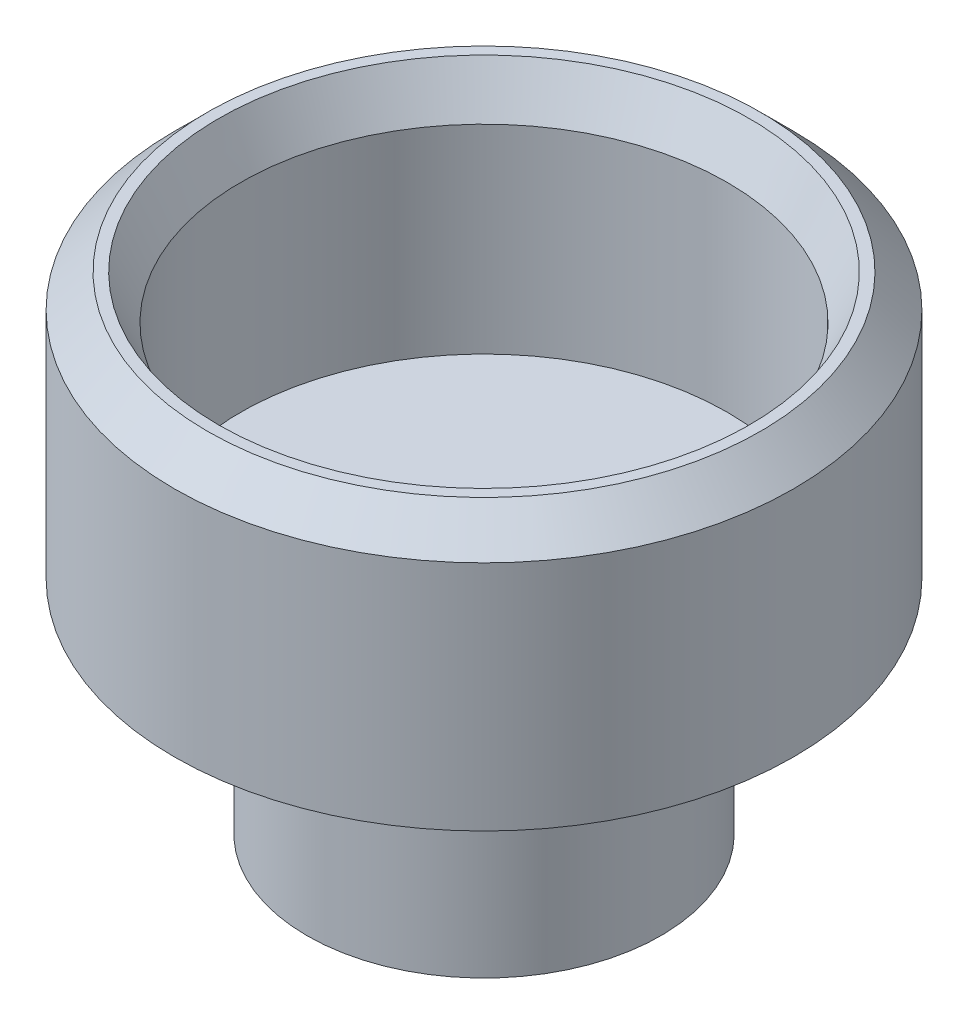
ISO-10303-21;
HEADER;
FILE_DESCRIPTION(('STEP AP214'),'2;1');
FILE_NAME('part.step','',(''),(''),'','','');
FILE_SCHEMA(('AUTOMOTIVE_DESIGN { 1 0 10303 214 1 1 1 1 }'));
ENDSEC;
DATA;
#1=APPLICATION_CONTEXT('core data for automotive mechanical design processes');
#2=APPLICATION_PROTOCOL_DEFINITION('international standard','automotive_design',2000,#1);
#3=PRODUCT_CONTEXT('',#1,'mechanical');
#4=PRODUCT('Part','Part','',(#3));
#5=PRODUCT_RELATED_PRODUCT_CATEGORY('part','',(#4));
#6=PRODUCT_DEFINITION_FORMATION('','',#4);
#7=PRODUCT_DEFINITION_CONTEXT('part definition',#1,'design');
#8=PRODUCT_DEFINITION('design','',#6,#7);
#9=PRODUCT_DEFINITION_SHAPE('','',#8);
#10=(LENGTH_UNIT() NAMED_UNIT(*) SI_UNIT(.MILLI.,.METRE.));
#11=(NAMED_UNIT(*) PLANE_ANGLE_UNIT() SI_UNIT($,.RADIAN.));
#12=(NAMED_UNIT(*) SI_UNIT($,.STERADIAN.) SOLID_ANGLE_UNIT());
#13=UNCERTAINTY_MEASURE_WITH_UNIT(LENGTH_MEASURE(1.E-05),#10,'distance_accuracy_value','');
#14=(GEOMETRIC_REPRESENTATION_CONTEXT(3) GLOBAL_UNCERTAINTY_ASSIGNED_CONTEXT((#13)) GLOBAL_UNIT_ASSIGNED_CONTEXT((#10,
#11,#12)) REPRESENTATION_CONTEXT('',''));
#15=CARTESIAN_POINT('',(0.,0.,0.));
#16=DIRECTION('',(0.,0.,1.));
#17=DIRECTION('',(1.,0.,0.));
#18=AXIS2_PLACEMENT_3D('',#15,#16,#17);
#19=CARTESIAN_POINT('',(0.,10.,0.));
#20=DIRECTION('',(0.,-1.,0.));
#21=DIRECTION('',(0.,0.,-1.));
#22=AXIS2_PLACEMENT_3D('',#19,#20,#21);
#23=CYLINDRICAL_SURFACE('',#22,8.);
#24=CARTESIAN_POINT('',(0.,6.00000000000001,0.));
#25=DIRECTION('',(0.,1.,0.));
#26=DIRECTION('',(0.,0.,1.));
#27=AXIS2_PLACEMENT_3D('',#24,#25,#26);
#28=CIRCLE('',#27,8.);
#29=CARTESIAN_POINT('',(0.,6.00000000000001,8.));
#30=VERTEX_POINT('',#29);
#31=EDGE_CURVE('E53',#30,#30,#28,.F.);
#32=ORIENTED_EDGE('',*,*,#31,.T.);
#33=EDGE_LOOP('',(#32));
#34=FACE_BOUND('',#33,.T.);
#35=CARTESIAN_POINT('',(0.,0.,0.));
#36=DIRECTION('',(0.,1.,0.));
#37=DIRECTION('',(0.,0.,1.));
#38=AXIS2_PLACEMENT_3D('',#35,#36,#37);
#39=CIRCLE('',#38,8.);
#40=CARTESIAN_POINT('',(0.,0.,8.));
#41=VERTEX_POINT('',#40);
#42=EDGE_CURVE('E56',#41,#41,#39,.T.);
#43=ORIENTED_EDGE('',*,*,#42,.T.);
#44=EDGE_LOOP('',(#43));
#45=FACE_BOUND('',#44,.T.);
#46=ADVANCED_FACE('F33',(#34,#45),#23,.T.);
#47=CARTESIAN_POINT('',(0.,0.,0.));
#48=DIRECTION('',(0.,1.,0.));
#49=DIRECTION('',(0.,0.,1.));
#50=AXIS2_PLACEMENT_3D('',#47,#48,#49);
#51=PLANE('',#50);
#52=CARTESIAN_POINT('',(0.,0.,0.));
#53=DIRECTION('',(0.,-1.,0.));
#54=DIRECTION('',(0.,0.,-1.));
#55=AXIS2_PLACEMENT_3D('',#52,#53,#54);
#56=CIRCLE('',#55,3.5);
#57=CARTESIAN_POINT('',(0.,0.,-3.5));
#58=VERTEX_POINT('',#57);
#59=EDGE_CURVE('E62',#58,#58,#56,.T.);
#60=ORIENTED_EDGE('',*,*,#59,.F.);
#61=EDGE_LOOP('',(#60));
#62=FACE_BOUND('',#61,.T.);
#63=ORIENTED_EDGE('',*,*,#42,.F.);
#64=EDGE_LOOP('',(#63));
#65=FACE_BOUND('',#64,.T.);
#66=ADVANCED_FACE('F87',(#62,#65),#51,.F.);
#67=CARTESIAN_POINT('',(0.,22.,0.));
#68=DIRECTION('',(0.,-1.,0.));
#69=DIRECTION('',(0.,0.,-1.));
#70=AXIS2_PLACEMENT_3D('',#67,#68,#69);
#71=CYLINDRICAL_SURFACE('',#70,14.);
#72=CARTESIAN_POINT('',(0.,20.5,0.));
#73=DIRECTION('',(0.,1.,0.));
#74=DIRECTION('',(0.,0.,1.));
#75=AXIS2_PLACEMENT_3D('',#72,#73,#74);
#76=CIRCLE('',#75,14.);
#77=CARTESIAN_POINT('',(0.,20.5,14.));
#78=VERTEX_POINT('',#77);
#79=EDGE_CURVE('E44',#78,#78,#76,.F.);
#80=ORIENTED_EDGE('',*,*,#79,.T.);
#81=EDGE_LOOP('',(#80));
#82=FACE_BOUND('',#81,.T.);
#83=CARTESIAN_POINT('',(0.,10.,0.));
#84=DIRECTION('',(0.,1.,0.));
#85=DIRECTION('',(0.,0.,1.));
#86=AXIS2_PLACEMENT_3D('',#83,#84,#85);
#87=CIRCLE('',#86,14.);
#88=CARTESIAN_POINT('',(0.,10.,14.));
#89=VERTEX_POINT('',#88);
#90=EDGE_CURVE('E59',#89,#89,#87,.T.);
#91=ORIENTED_EDGE('',*,*,#90,.T.);
#92=EDGE_LOOP('',(#91));
#93=FACE_BOUND('',#92,.T.);
#94=ADVANCED_FACE('F93',(#82,#93),#71,.T.);
#95=CARTESIAN_POINT('',(0.,22.,0.));
#96=DIRECTION('',(0.,1.,0.));
#97=DIRECTION('',(0.,0.,1.));
#98=AXIS2_PLACEMENT_3D('',#95,#96,#97);
#99=PLANE('',#98);
#100=CARTESIAN_POINT('',(0.,22.,0.));
#101=DIRECTION('',(0.,1.,0.));
#102=DIRECTION('',(0.,0.,1.));
#103=AXIS2_PLACEMENT_3D('',#100,#101,#102);
#104=CIRCLE('',#103,12.);
#105=CARTESIAN_POINT('',(0.,22.,12.));
#106=VERTEX_POINT('',#105);
#107=EDGE_CURVE('E10',#106,#106,#104,.F.);
#108=ORIENTED_EDGE('',*,*,#107,.T.);
#109=EDGE_LOOP('',(#108));
#110=FACE_BOUND('',#109,.T.);
#111=CARTESIAN_POINT('',(0.,22.,0.));
#112=DIRECTION('',(0.,1.,0.));
#113=DIRECTION('',(0.,0.,1.));
#114=AXIS2_PLACEMENT_3D('',#111,#112,#113);
#115=CIRCLE('',#114,12.5);
#116=CARTESIAN_POINT('',(0.,22.,12.5));
#117=VERTEX_POINT('',#116);
#118=EDGE_CURVE('E48',#117,#117,#115,.T.);
#119=ORIENTED_EDGE('',*,*,#118,.T.);
#120=EDGE_LOOP('',(#119));
#121=FACE_BOUND('',#120,.T.);
#122=ADVANCED_FACE('F102',(#110,#121),#99,.T.);
#123=CARTESIAN_POINT('',(0.,10.,0.));
#124=DIRECTION('',(0.,1.,0.));
#125=DIRECTION('',(0.,0.,1.));
#126=AXIS2_PLACEMENT_3D('',#123,#124,#125);
#127=CONICAL_SURFACE('',#126,14.,0.982793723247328);
#128=ORIENTED_EDGE('',*,*,#31,.F.);
#129=EDGE_LOOP('',(#128));
#130=FACE_BOUND('',#129,.T.);
#131=ORIENTED_EDGE('',*,*,#90,.F.);
#132=EDGE_LOOP('',(#131));
#133=FACE_BOUND('',#132,.T.);
#134=ADVANCED_FACE('F99',(#130,#133),#127,.T.);
#135=CARTESIAN_POINT('',(0.,22.,0.));
#136=DIRECTION('',(0.,-1.,0.));
#137=DIRECTION('',(0.,0.,-1.));
#138=AXIS2_PLACEMENT_3D('',#135,#136,#137);
#139=CONICAL_SURFACE('',#138,12.5,0.785398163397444);
#140=ORIENTED_EDGE('',*,*,#79,.F.);
#141=EDGE_LOOP('',(#140));
#142=FACE_BOUND('',#141,.T.);
#143=ORIENTED_EDGE('',*,*,#118,.F.);
#144=EDGE_LOOP('',(#143));
#145=FACE_BOUND('',#144,.T.);
#146=ADVANCED_FACE('F101',(#142,#145),#139,.T.);
#147=CARTESIAN_POINT('',(0.,11.,0.));
#148=DIRECTION('',(0.,-1.,0.));
#149=DIRECTION('',(0.,0.,-1.));
#150=AXIS2_PLACEMENT_3D('',#147,#148,#149);
#151=CYLINDRICAL_SURFACE('',#150,3.5);
#152=CARTESIAN_POINT('',(0.,11.,0.));
#153=DIRECTION('',(0.,1.,0.));
#154=DIRECTION('',(0.,0.,1.));
#155=AXIS2_PLACEMENT_3D('',#152,#153,#154);
#156=CIRCLE('',#155,3.5);
#157=CARTESIAN_POINT('',(0.,11.,3.5));
#158=VERTEX_POINT('',#157);
#159=EDGE_CURVE('E65',#158,#158,#156,.F.);
#160=ORIENTED_EDGE('',*,*,#159,.F.);
#161=EDGE_LOOP('',(#160));
#162=FACE_BOUND('',#161,.T.);
#163=ORIENTED_EDGE('',*,*,#59,.T.);
#164=EDGE_LOOP('',(#163));
#165=FACE_BOUND('',#164,.T.);
#166=ADVANCED_FACE('F83',(#162,#165),#151,.F.);
#167=CARTESIAN_POINT('',(0.,11.,0.));
#168=DIRECTION('',(0.,1.,0.));
#169=DIRECTION('',(0.,0.,1.));
#170=AXIS2_PLACEMENT_3D('',#167,#168,#169);
#171=PLANE('',#170);
#172=CARTESIAN_POINT('',(0.,11.,0.));
#173=DIRECTION('',(0.,1.,0.));
#174=DIRECTION('',(0.,0.,1.));
#175=AXIS2_PLACEMENT_3D('',#172,#173,#174);
#176=CIRCLE('',#175,11.);
#177=CARTESIAN_POINT('',(0.,11.,11.));
#178=VERTEX_POINT('',#177);
#179=EDGE_CURVE('E68',#178,#178,#176,.T.);
#180=ORIENTED_EDGE('',*,*,#179,.T.);
#181=EDGE_LOOP('',(#180));
#182=FACE_BOUND('',#181,.T.);
#183=ORIENTED_EDGE('',*,*,#159,.T.);
#184=EDGE_LOOP('',(#183));
#185=FACE_BOUND('',#184,.T.);
#186=ADVANCED_FACE('F72',(#182,#185),#171,.T.);
#187=CARTESIAN_POINT('',(0.,11.,0.));
#188=DIRECTION('',(0.,1.,0.));
#189=DIRECTION('',(0.,0.,1.));
#190=AXIS2_PLACEMENT_3D('',#187,#188,#189);
#191=CYLINDRICAL_SURFACE('',#190,11.);
#192=CARTESIAN_POINT('',(0.,20.,0.));
#193=DIRECTION('',(0.,1.,0.));
#194=DIRECTION('',(0.,0.,1.));
#195=AXIS2_PLACEMENT_3D('',#192,#193,#194);
#196=CIRCLE('',#195,11.);
#197=CARTESIAN_POINT('',(0.,20.,11.));
#198=VERTEX_POINT('',#197);
#199=EDGE_CURVE('E40',#198,#198,#196,.T.);
#200=ORIENTED_EDGE('',*,*,#199,.T.);
#201=EDGE_LOOP('',(#200));
#202=FACE_BOUND('',#201,.T.);
#203=ORIENTED_EDGE('',*,*,#179,.F.);
#204=EDGE_LOOP('',(#203));
#205=FACE_BOUND('',#204,.T.);
#206=ADVANCED_FACE('F75',(#202,#205),#191,.F.);
#207=CARTESIAN_POINT('',(0.,20.,0.));
#208=DIRECTION('',(0.,1.,0.));
#209=DIRECTION('',(0.,0.,1.));
#210=AXIS2_PLACEMENT_3D('',#207,#208,#209);
#211=CONICAL_SURFACE('',#210,11.,0.463647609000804);
#212=ORIENTED_EDGE('',*,*,#107,.F.);
#213=EDGE_LOOP('',(#212));
#214=FACE_BOUND('',#213,.T.);
#215=ORIENTED_EDGE('',*,*,#199,.F.);
#216=EDGE_LOOP('',(#215));
#217=FACE_BOUND('',#216,.T.);
#218=ADVANCED_FACE('F35',(#214,#217),#211,.F.);
#219=CLOSED_SHELL('',(#46,#66,#94,#122,#134,#146,#166,#186,#206,#218));
#220=MANIFOLD_SOLID_BREP('B2',#219);
#221=ADVANCED_BREP_SHAPE_REPRESENTATION('',(#18,#220),#14);
#222=SHAPE_DEFINITION_REPRESENTATION(#9,#221);
ENDSEC;
END-ISO-10303-21;
